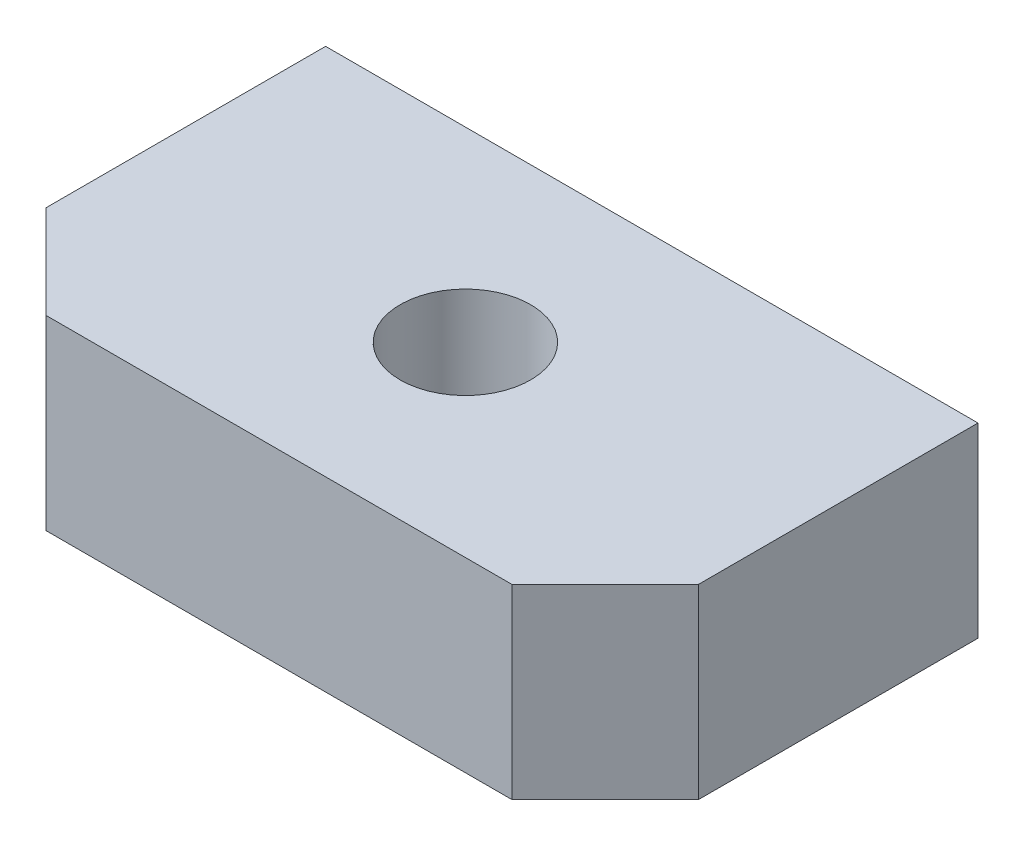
ISO-10303-21;
HEADER;
FILE_DESCRIPTION(('STEP AP214'),'2;1');
FILE_NAME('part.step','',(''),(''),'','','');
FILE_SCHEMA(('AUTOMOTIVE_DESIGN { 1 0 10303 214 1 1 1 1 }'));
ENDSEC;
DATA;
#1=APPLICATION_CONTEXT('core data for automotive mechanical design processes');
#2=APPLICATION_PROTOCOL_DEFINITION('international standard','automotive_design',2000,#1);
#3=PRODUCT_CONTEXT('',#1,'mechanical');
#4=PRODUCT('Part','Part','',(#3));
#5=PRODUCT_RELATED_PRODUCT_CATEGORY('part','',(#4));
#6=PRODUCT_DEFINITION_FORMATION('','',#4);
#7=PRODUCT_DEFINITION_CONTEXT('part definition',#1,'design');
#8=PRODUCT_DEFINITION('design','',#6,#7);
#9=PRODUCT_DEFINITION_SHAPE('','',#8);
#10=(LENGTH_UNIT() NAMED_UNIT(*) SI_UNIT(.MILLI.,.METRE.));
#11=(NAMED_UNIT(*) PLANE_ANGLE_UNIT() SI_UNIT($,.RADIAN.));
#12=(NAMED_UNIT(*) SI_UNIT($,.STERADIAN.) SOLID_ANGLE_UNIT());
#13=UNCERTAINTY_MEASURE_WITH_UNIT(LENGTH_MEASURE(1.E-05),#10,'distance_accuracy_value','');
#14=(GEOMETRIC_REPRESENTATION_CONTEXT(3) GLOBAL_UNCERTAINTY_ASSIGNED_CONTEXT((#13)) GLOBAL_UNIT_ASSIGNED_CONTEXT((#10,
#11,#12)) REPRESENTATION_CONTEXT('',''));
#15=CARTESIAN_POINT('',(0.,0.,0.));
#16=DIRECTION('',(0.,0.,1.));
#17=DIRECTION('',(1.,0.,0.));
#18=AXIS2_PLACEMENT_3D('',#15,#16,#17);
#19=CARTESIAN_POINT('',(12.5,0.,10.1000000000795));
#20=DIRECTION('',(0.,0.,-1.));
#21=DIRECTION('',(-1.,0.,0.));
#22=AXIS2_PLACEMENT_3D('',#19,#20,#21);
#23=CONICAL_SURFACE('',#22,1.64999999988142,1.02974425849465);
#24=CARTESIAN_POINT('',(12.4999999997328,0.,11.0914200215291));
#25=VERTEX_POINT('',#24);
#26=VERTEX_LOOP('',#25);
#27=FACE_BOUND('',#26,.T.);
#28=CARTESIAN_POINT('',(12.5,0.,10.1));
#29=DIRECTION('',(0.,0.,-1.));
#30=DIRECTION('',(-1.,0.,0.));
#31=AXIS2_PLACEMENT_3D('',#28,#29,#30);
#32=CIRCLE('',#31,1.65);
#33=CARTESIAN_POINT('',(10.85,0.,10.1));
#34=VERTEX_POINT('',#33);
#35=EDGE_CURVE('E78',#34,#34,#32,.T.);
#36=ORIENTED_EDGE('',*,*,#35,.T.);
#37=EDGE_LOOP('',(#36));
#38=FACE_BOUND('',#37,.T.);
#39=ADVANCED_FACE('F17',(#27,#38),#23,.F.);
#40=CARTESIAN_POINT('',(-12.5,0.,10.1000000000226));
#41=DIRECTION('',(0.,0.,-1.));
#42=DIRECTION('',(-1.,0.,0.));
#43=AXIS2_PLACEMENT_3D('',#40,#41,#42);
#44=CONICAL_SURFACE('',#43,1.64999999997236,1.02974425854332);
#45=CARTESIAN_POINT('',(-12.5000000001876,0.,11.0914200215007));
#46=VERTEX_POINT('',#45);
#47=VERTEX_LOOP('',#46);
#48=FACE_BOUND('',#47,.T.);
#49=CARTESIAN_POINT('',(-12.5,0.,10.1));
#50=DIRECTION('',(0.,0.,-1.));
#51=DIRECTION('',(-1.,0.,0.));
#52=AXIS2_PLACEMENT_3D('',#49,#50,#51);
#53=CIRCLE('',#52,1.65);
#54=CARTESIAN_POINT('',(-14.15,0.,10.1));
#55=VERTEX_POINT('',#54);
#56=EDGE_CURVE('E80',#55,#55,#53,.T.);
#57=ORIENTED_EDGE('',*,*,#56,.T.);
#58=EDGE_LOOP('',(#57));
#59=FACE_BOUND('',#58,.T.);
#60=ADVANCED_FACE('F75',(#48,#59),#44,.F.);
#61=CARTESIAN_POINT('',(12.5,0.,0.));
#62=DIRECTION('',(0.,0.,-1.));
#63=DIRECTION('',(-1.,0.,0.));
#64=AXIS2_PLACEMENT_3D('',#61,#62,#63);
#65=CYLINDRICAL_SURFACE('',#64,1.65);
#66=ORIENTED_EDGE('',*,*,#35,.F.);
#67=EDGE_LOOP('',(#66));
#68=FACE_BOUND('',#67,.T.);
#69=CARTESIAN_POINT('',(12.5,0.,0.));
#70=DIRECTION('',(0.,0.,-1.));
#71=DIRECTION('',(-1.,0.,0.));
#72=AXIS2_PLACEMENT_3D('',#69,#70,#71);
#73=CIRCLE('',#72,1.65);
#74=CARTESIAN_POINT('',(10.85,0.,0.));
#75=VERTEX_POINT('',#74);
#76=EDGE_CURVE('E94',#75,#75,#73,.T.);
#77=ORIENTED_EDGE('',*,*,#76,.T.);
#78=EDGE_LOOP('',(#77));
#79=FACE_BOUND('',#78,.T.);
#80=ADVANCED_FACE('F147',(#68,#79),#65,.F.);
#81=CARTESIAN_POINT('',(-12.5,0.,0.));
#82=DIRECTION('',(0.,0.,-1.));
#83=DIRECTION('',(-1.,0.,0.));
#84=AXIS2_PLACEMENT_3D('',#81,#82,#83);
#85=CYLINDRICAL_SURFACE('',#84,1.65);
#86=ORIENTED_EDGE('',*,*,#56,.F.);
#87=EDGE_LOOP('',(#86));
#88=FACE_BOUND('',#87,.T.);
#89=CARTESIAN_POINT('',(-12.5,0.,0.));
#90=DIRECTION('',(0.,0.,-1.));
#91=DIRECTION('',(-1.,0.,0.));
#92=AXIS2_PLACEMENT_3D('',#89,#90,#91);
#93=CIRCLE('',#92,1.65);
#94=CARTESIAN_POINT('',(-14.15,0.,0.));
#95=VERTEX_POINT('',#94);
#96=EDGE_CURVE('E91',#95,#95,#93,.T.);
#97=ORIENTED_EDGE('',*,*,#96,.T.);
#98=EDGE_LOOP('',(#97));
#99=FACE_BOUND('',#98,.T.);
#100=ADVANCED_FACE('F143',(#88,#99),#85,.F.);
#101=CARTESIAN_POINT('',(-17.5,-5.,20.));
#102=DIRECTION('',(0.,1.,0.));
#103=DIRECTION('',(0.,0.,1.));
#104=AXIS2_PLACEMENT_3D('',#101,#102,#103);
#105=PLANE('',#104);
#106=DIRECTION('',(0.707106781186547,0.,0.707106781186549));
#107=VECTOR('',#106,1.);
#108=CARTESIAN_POINT('',(-12.5,-5.,20.));
#109=LINE('',#108,#107);
#110=CARTESIAN_POINT('',(-17.5,-5.,15.));
#111=VERTEX_POINT('',#110);
#112=CARTESIAN_POINT('',(-12.5,-5.,20.));
#113=VERTEX_POINT('',#112);
#114=EDGE_CURVE('E275',#111,#113,#109,.T.);
#115=ORIENTED_EDGE('',*,*,#114,.F.);
#116=DIRECTION('',(0.,0.,1.));
#117=VECTOR('',#116,1.);
#118=CARTESIAN_POINT('',(-17.5,-5.,20.));
#119=LINE('',#118,#117);
#120=CARTESIAN_POINT('',(-17.5,-5.,0.));
#121=VERTEX_POINT('',#120);
#122=EDGE_CURVE('E90',#111,#121,#119,.F.);
#123=ORIENTED_EDGE('',*,*,#122,.T.);
#124=DIRECTION('',(1.,0.,0.));
#125=VECTOR('',#124,1.);
#126=CARTESIAN_POINT('',(0.,-5.,0.));
#127=LINE('',#126,#125);
#128=CARTESIAN_POINT('',(17.5,-5.,0.));
#129=VERTEX_POINT('',#128);
#130=EDGE_CURVE('E93',#121,#129,#127,.T.);
#131=ORIENTED_EDGE('',*,*,#130,.T.);
#132=DIRECTION('',(0.,0.,1.));
#133=VECTOR('',#132,1.);
#134=CARTESIAN_POINT('',(17.5,-5.,20.));
#135=LINE('',#134,#133);
#136=CARTESIAN_POINT('',(17.5,-5.,15.));
#137=VERTEX_POINT('',#136);
#138=EDGE_CURVE('E298',#129,#137,#135,.T.);
#139=ORIENTED_EDGE('',*,*,#138,.T.);
#140=DIRECTION('',(0.707106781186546,0.,-0.707106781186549));
#141=VECTOR('',#140,1.);
#142=CARTESIAN_POINT('',(12.5,-5.,20.));
#143=LINE('',#142,#141);
#144=CARTESIAN_POINT('',(12.5,-5.,20.));
#145=VERTEX_POINT('',#144);
#146=EDGE_CURVE('E296',#145,#137,#143,.T.);
#147=ORIENTED_EDGE('',*,*,#146,.F.);
#148=DIRECTION('',(1.,0.,0.));
#149=VECTOR('',#148,1.);
#150=CARTESIAN_POINT('',(0.,-5.,20.));
#151=LINE('',#150,#149);
#152=EDGE_CURVE('E277',#113,#145,#151,.T.);
#153=ORIENTED_EDGE('',*,*,#152,.F.);
#154=EDGE_LOOP('',(#115,#123,#131,#139,#147,#153));
#155=FACE_BOUND('',#154,.T.);
#156=CARTESIAN_POINT('',(0.,-5.,10.));
#157=DIRECTION('',(0.,1.,0.));
#158=DIRECTION('',(0.,0.,1.));
#159=AXIS2_PLACEMENT_3D('',#156,#157,#158);
#160=CIRCLE('',#159,3.5);
#161=CARTESIAN_POINT('',(0.,-5.,13.5));
#162=VERTEX_POINT('',#161);
#163=EDGE_CURVE('E20',#162,#162,#160,.T.);
#164=ORIENTED_EDGE('',*,*,#163,.T.);
#165=EDGE_LOOP('',(#164));
#166=FACE_BOUND('',#165,.T.);
#167=ADVANCED_FACE('F101',(#155,#166),#105,.F.);
#168=CARTESIAN_POINT('',(0.,5.,10.));
#169=DIRECTION('',(0.,1.,0.));
#170=DIRECTION('',(0.,0.,1.));
#171=AXIS2_PLACEMENT_3D('',#168,#169,#170);
#172=CYLINDRICAL_SURFACE('',#171,3.5);
#173=ORIENTED_EDGE('',*,*,#163,.F.);
#174=EDGE_LOOP('',(#173));
#175=FACE_BOUND('',#174,.T.);
#176=CARTESIAN_POINT('',(0.,5.,10.));
#177=DIRECTION('',(0.,1.,0.));
#178=DIRECTION('',(0.,0.,1.));
#179=AXIS2_PLACEMENT_3D('',#176,#177,#178);
#180=CIRCLE('',#179,3.5);
#181=CARTESIAN_POINT('',(0.,5.,13.5));
#182=VERTEX_POINT('',#181);
#183=EDGE_CURVE('E86',#182,#182,#180,.T.);
#184=ORIENTED_EDGE('',*,*,#183,.T.);
#185=EDGE_LOOP('',(#184));
#186=FACE_BOUND('',#185,.T.);
#187=ADVANCED_FACE('F103',(#175,#186),#172,.F.);
#188=CARTESIAN_POINT('',(0.,0.,0.));
#189=DIRECTION('',(0.,0.,1.));
#190=DIRECTION('',(1.,0.,0.));
#191=AXIS2_PLACEMENT_3D('',#188,#189,#190);
#192=PLANE('',#191);
#193=ORIENTED_EDGE('',*,*,#130,.F.);
#194=DIRECTION('',(0.,1.,0.));
#195=VECTOR('',#194,1.);
#196=CARTESIAN_POINT('',(-17.5,5.,0.));
#197=LINE('',#196,#195);
#198=CARTESIAN_POINT('',(-17.5,5.,0.));
#199=VERTEX_POINT('',#198);
#200=EDGE_CURVE('E284',#121,#199,#197,.T.);
#201=ORIENTED_EDGE('',*,*,#200,.T.);
#202=DIRECTION('',(1.,0.,0.));
#203=VECTOR('',#202,1.);
#204=CARTESIAN_POINT('',(-17.5,5.,0.));
#205=LINE('',#204,#203);
#206=CARTESIAN_POINT('',(17.5,5.,0.));
#207=VERTEX_POINT('',#206);
#208=EDGE_CURVE('E89',#199,#207,#205,.T.);
#209=ORIENTED_EDGE('',*,*,#208,.T.);
#210=DIRECTION('',(0.,1.,0.));
#211=VECTOR('',#210,1.);
#212=CARTESIAN_POINT('',(17.5,5.,0.));
#213=LINE('',#212,#211);
#214=EDGE_CURVE('E301',#207,#129,#213,.F.);
#215=ORIENTED_EDGE('',*,*,#214,.T.);
#216=EDGE_LOOP('',(#193,#201,#209,#215));
#217=FACE_BOUND('',#216,.T.);
#218=ORIENTED_EDGE('',*,*,#96,.F.);
#219=EDGE_LOOP('',(#218));
#220=FACE_BOUND('',#219,.T.);
#221=ORIENTED_EDGE('',*,*,#76,.F.);
#222=EDGE_LOOP('',(#221));
#223=FACE_BOUND('',#222,.T.);
#224=ADVANCED_FACE('F106',(#217,#220,#223),#192,.F.);
#225=CARTESIAN_POINT('',(17.5,5.,20.));
#226=DIRECTION('',(-1.,0.,0.));
#227=DIRECTION('',(0.,0.,1.));
#228=AXIS2_PLACEMENT_3D('',#225,#226,#227);
#229=PLANE('',#228);
#230=DIRECTION('',(0.,1.,0.));
#231=VECTOR('',#230,1.);
#232=CARTESIAN_POINT('',(17.5,0.,15.));
#233=LINE('',#232,#231);
#234=CARTESIAN_POINT('',(17.5,5.,15.));
#235=VERTEX_POINT('',#234);
#236=EDGE_CURVE('E294',#137,#235,#233,.T.);
#237=ORIENTED_EDGE('',*,*,#236,.F.);
#238=ORIENTED_EDGE('',*,*,#138,.F.);
#239=ORIENTED_EDGE('',*,*,#214,.F.);
#240=DIRECTION('',(0.,0.,-1.));
#241=VECTOR('',#240,1.);
#242=CARTESIAN_POINT('',(17.5,5.,20.));
#243=LINE('',#242,#241);
#244=EDGE_CURVE('E308',#207,#235,#243,.F.);
#245=ORIENTED_EDGE('',*,*,#244,.T.);
#246=EDGE_LOOP('',(#237,#238,#239,#245));
#247=FACE_BOUND('',#246,.T.);
#248=ADVANCED_FACE('F133',(#247),#229,.F.);
#249=CARTESIAN_POINT('',(12.5,0.,20.));
#250=DIRECTION('',(0.707106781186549,0.,0.707106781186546));
#251=DIRECTION('',(0.707106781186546,0.,-0.707106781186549));
#252=AXIS2_PLACEMENT_3D('',#249,#250,#251);
#253=PLANE('',#252);
#254=DIRECTION('',(-0.707106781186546,0.,0.707106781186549));
#255=VECTOR('',#254,1.);
#256=CARTESIAN_POINT('',(17.5,5.,15.));
#257=LINE('',#256,#255);
#258=CARTESIAN_POINT('',(12.5,5.,20.));
#259=VERTEX_POINT('',#258);
#260=EDGE_CURVE('E309',#235,#259,#257,.T.);
#261=ORIENTED_EDGE('',*,*,#260,.T.);
#262=DIRECTION('',(0.,1.,0.));
#263=VECTOR('',#262,1.);
#264=CARTESIAN_POINT('',(12.5,0.,20.));
#265=LINE('',#264,#263);
#266=EDGE_CURVE('E280',#145,#259,#265,.T.);
#267=ORIENTED_EDGE('',*,*,#266,.F.);
#268=ORIENTED_EDGE('',*,*,#146,.T.);
#269=ORIENTED_EDGE('',*,*,#236,.T.);
#270=EDGE_LOOP('',(#261,#267,#268,#269));
#271=FACE_BOUND('',#270,.T.);
#272=ADVANCED_FACE('F129',(#271),#253,.T.);
#273=CARTESIAN_POINT('',(0.,0.,20.));
#274=DIRECTION('',(0.,0.,1.));
#275=DIRECTION('',(1.,0.,0.));
#276=AXIS2_PLACEMENT_3D('',#273,#274,#275);
#277=PLANE('',#276);
#278=ORIENTED_EDGE('',*,*,#152,.T.);
#279=ORIENTED_EDGE('',*,*,#266,.T.);
#280=DIRECTION('',(1.,0.,0.));
#281=VECTOR('',#280,1.);
#282=CARTESIAN_POINT('',(-17.5,5.,20.));
#283=LINE('',#282,#281);
#284=CARTESIAN_POINT('',(-12.5,5.,20.));
#285=VERTEX_POINT('',#284);
#286=EDGE_CURVE('E314',#259,#285,#283,.F.);
#287=ORIENTED_EDGE('',*,*,#286,.T.);
#288=DIRECTION('',(0.,1.,0.));
#289=VECTOR('',#288,1.);
#290=CARTESIAN_POINT('',(-12.5,0.,20.));
#291=LINE('',#290,#289);
#292=EDGE_CURVE('E279',#113,#285,#291,.T.);
#293=ORIENTED_EDGE('',*,*,#292,.F.);
#294=EDGE_LOOP('',(#278,#279,#287,#293));
#295=FACE_BOUND('',#294,.T.);
#296=ADVANCED_FACE('F125',(#295),#277,.T.);
#297=CARTESIAN_POINT('',(-12.5,0.,20.));
#298=DIRECTION('',(-0.707106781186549,0.,0.707106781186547));
#299=DIRECTION('',(0.707106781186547,0.,0.707106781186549));
#300=AXIS2_PLACEMENT_3D('',#297,#298,#299);
#301=PLANE('',#300);
#302=ORIENTED_EDGE('',*,*,#114,.T.);
#303=ORIENTED_EDGE('',*,*,#292,.T.);
#304=DIRECTION('',(-0.707106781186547,0.,-0.707106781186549));
#305=VECTOR('',#304,1.);
#306=CARTESIAN_POINT('',(-12.5,5.,20.));
#307=LINE('',#306,#305);
#308=CARTESIAN_POINT('',(-17.5,5.,15.));
#309=VERTEX_POINT('',#308);
#310=EDGE_CURVE('E26',#285,#309,#307,.T.);
#311=ORIENTED_EDGE('',*,*,#310,.T.);
#312=DIRECTION('',(0.,1.,0.));
#313=VECTOR('',#312,1.);
#314=CARTESIAN_POINT('',(-17.5,5.,15.));
#315=LINE('',#314,#313);
#316=EDGE_CURVE('E34',#309,#111,#315,.F.);
#317=ORIENTED_EDGE('',*,*,#316,.T.);
#318=EDGE_LOOP('',(#302,#303,#311,#317));
#319=FACE_BOUND('',#318,.T.);
#320=ADVANCED_FACE('F119',(#319),#301,.T.);
#321=CARTESIAN_POINT('',(-17.5,5.,20.));
#322=DIRECTION('',(1.,0.,0.));
#323=DIRECTION('',(0.,1.,0.));
#324=AXIS2_PLACEMENT_3D('',#321,#322,#323);
#325=PLANE('',#324);
#326=ORIENTED_EDGE('',*,*,#316,.F.);
#327=DIRECTION('',(0.,0.,-1.));
#328=VECTOR('',#327,1.);
#329=CARTESIAN_POINT('',(-17.5,5.,20.));
#330=LINE('',#329,#328);
#331=EDGE_CURVE('E11',#309,#199,#330,.T.);
#332=ORIENTED_EDGE('',*,*,#331,.T.);
#333=ORIENTED_EDGE('',*,*,#200,.F.);
#334=ORIENTED_EDGE('',*,*,#122,.F.);
#335=EDGE_LOOP('',(#326,#332,#333,#334));
#336=FACE_BOUND('',#335,.T.);
#337=ADVANCED_FACE('F112',(#336),#325,.F.);
#338=CARTESIAN_POINT('',(-17.5,5.,20.));
#339=DIRECTION('',(0.,-1.,0.));
#340=DIRECTION('',(0.,0.,-1.));
#341=AXIS2_PLACEMENT_3D('',#338,#339,#340);
#342=PLANE('',#341);
#343=ORIENTED_EDGE('',*,*,#310,.F.);
#344=ORIENTED_EDGE('',*,*,#286,.F.);
#345=ORIENTED_EDGE('',*,*,#260,.F.);
#346=ORIENTED_EDGE('',*,*,#244,.F.);
#347=ORIENTED_EDGE('',*,*,#208,.F.);
#348=ORIENTED_EDGE('',*,*,#331,.F.);
#349=EDGE_LOOP('',(#343,#344,#345,#346,#347,#348));
#350=FACE_BOUND('',#349,.T.);
#351=ORIENTED_EDGE('',*,*,#183,.F.);
#352=EDGE_LOOP('',(#351));
#353=FACE_BOUND('',#352,.T.);
#354=ADVANCED_FACE('F110',(#350,#353),#342,.F.);
#355=CLOSED_SHELL('',(#39,#60,#80,#100,#167,#187,#224,#248,#272,#296,#320,#337,#354));
#356=MANIFOLD_SOLID_BREP('B1',#355);
#357=ADVANCED_BREP_SHAPE_REPRESENTATION('',(#18,#356),#14);
#358=SHAPE_DEFINITION_REPRESENTATION(#9,#357);
ENDSEC;
END-ISO-10303-21;
